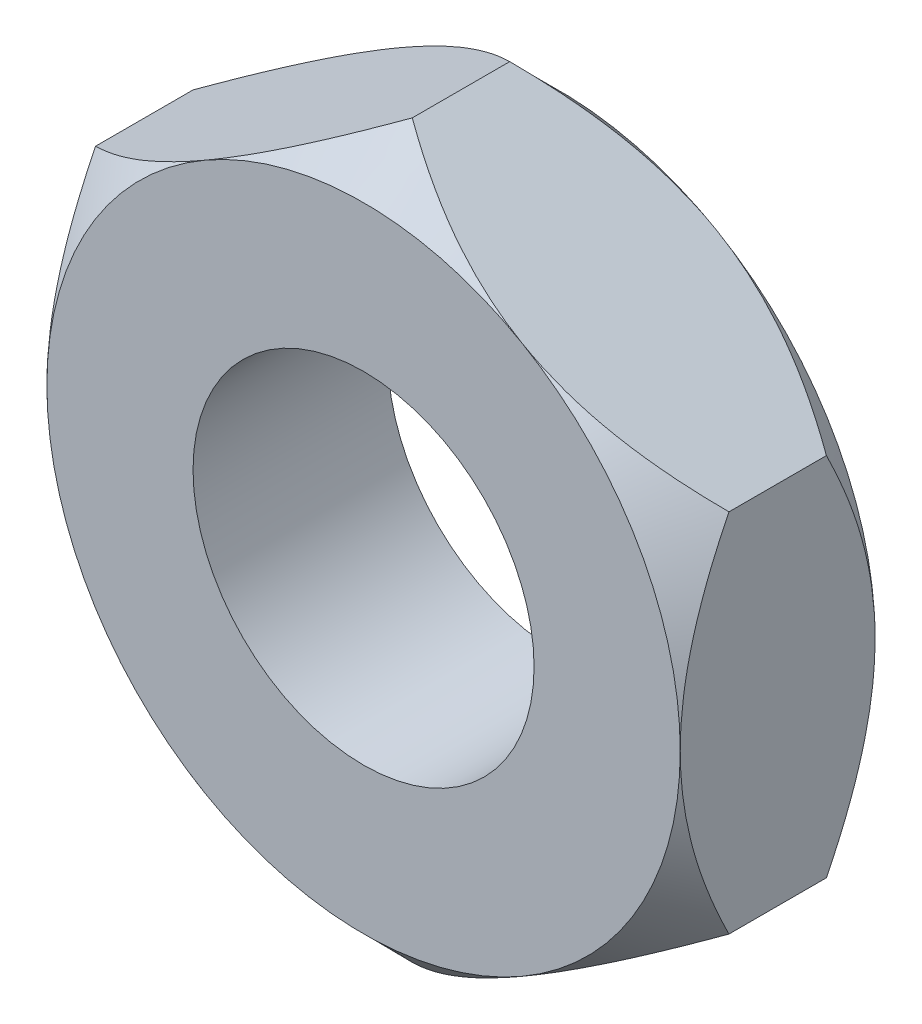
from build123d import *

# Parameters (mm, degrees)
EXTRUSION1_DEPTH          = 2
TROU_TARAUD_M8X1_01_D     = 7
TROU_TARAUD_M8X1_01_DEPTH = 19
TROU_TARAUD_M8X1_01_TIP   = 2.103012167


with BuildPart() as part:
    # Esquisse1 → Extrusion1 (new, symmetric)
    with BuildSketch(Plane.XY):
        Polygon((0, 7.505553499), (-6.5, 3.75277675), (-6.5, -3.75277675), (0, -7.505553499), (6.5, -3.75277675), (6.5, 3.75277675), align=None)
    extrude(amount=EXTRUSION1_DEPTH, both=True)

    # Esquisse2 → Enl_vement de mati_re-R_volution1 (revolve, cut)
    with BuildSketch(Plane(origin=(0, 0, 0), x_dir=(0, 0, -1), z_dir=(1, 0, 0))):
        Polygon((-2, 7.505553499), (-2, 6.5), (-1, 7.505553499), align=None)
    enl_vement_de_mati_re_r_volution1 = revolve(axis=Axis((0, 0, 0), (0, 0, 1)), mode=Mode.SUBTRACT)

    # Sym_trie2: Enl_vement de mati_re-R_volution1 across plane
    add(enl_vement_de_mati_re_r_volution1.mirror(Plane.XY), mode=Mode.SUBTRACT)

    # Trou taraud_ M8x1.01
    with Locations(Plane.XY.offset(2)):
        with Locations((0, 0)):
            Hole(TROU_TARAUD_M8X1_01_D / 2, depth=TROU_TARAUD_M8X1_01_DEPTH)
            with Locations((0, 0, -(TROU_TARAUD_M8X1_01_DEPTH + TROU_TARAUD_M8X1_01_TIP / 2))):  # 118° drill point
                Cone(0, TROU_TARAUD_M8X1_01_D / 2, TROU_TARAUD_M8X1_01_TIP, mode=Mode.SUBTRACT)


solid = part.part
